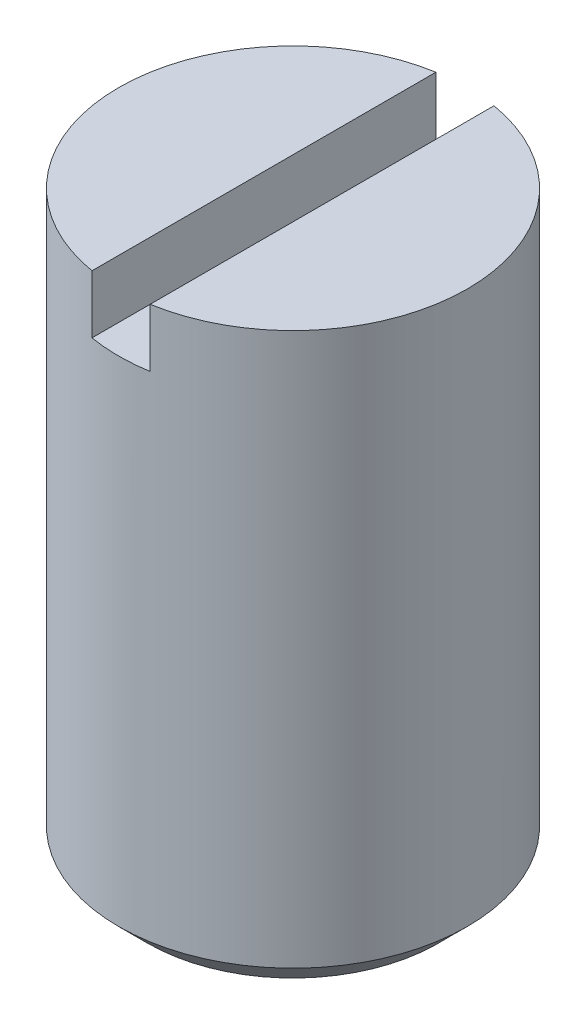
from build123d import *

# Parameters (mm, degrees)
SKETCH1_R          = 3
EXTRUDE1_DEPTH     = 10
CHAMFER1_SIZE      = 0.5
SKETCH2_W          = 1
SKETCH2_H          = 6
CUT_EXTRUDE1_DEPTH = 1


with BuildPart() as part:
    # Sketch1 → Extrude1 (new body)
    with BuildSketch(Plane(origin=(0, 0, 0), x_dir=(1, 0, 0), z_dir=(0, 1, 0))):
        with Locations(Location((0, 0, 0), (0, 0, 270))):
            Circle(SKETCH1_R)
    extrude(amount=EXTRUDE1_DEPTH)

    # Chamfer1
    chamfer1_edges = [part.edges().sort_by_distance(p)[0] for p in [
        (0, 0, -3),
    ]]
    chamfer(chamfer1_edges, length=CHAMFER1_SIZE)

    # Sketch2 → Cut-Extrude1 (cut)
    with BuildSketch(Plane(origin=(0, 10, 0), x_dir=(-1, 0, 0), z_dir=(0, 1, 0))):
        Rectangle(SKETCH2_W, SKETCH2_H)
    extrude(amount=-CUT_EXTRUDE1_DEPTH, mode=Mode.SUBTRACT)


solid = part.part
